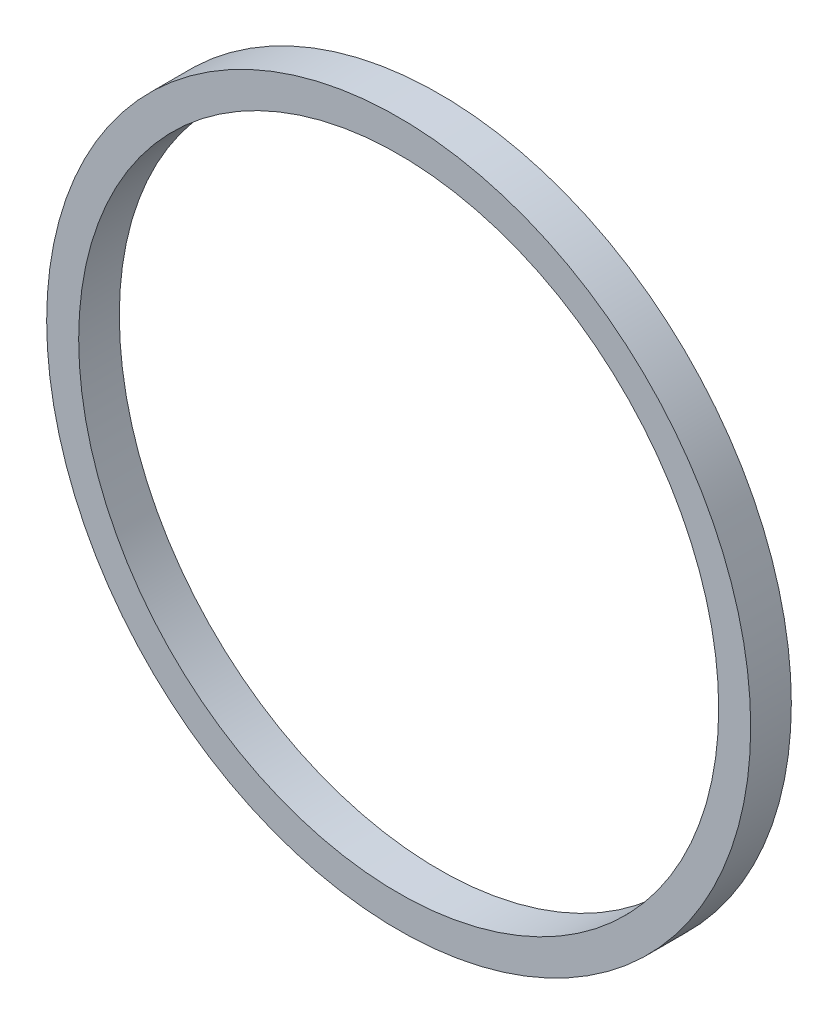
from build123d import *

# Parameters (mm, degrees)
EXTRUDE1_DEPTH      = 3.175
EXTRUDE1_DEPTH_BACK = 3.175
SKETCH1_R           = 55
SKETCH1_R_2         = 50


with BuildPart() as part:
    # Sketch1 → Extrude1 (new, two sides: drawn at the far end of the back side and taken through both)
    with BuildSketch(Plane.XY.offset(-EXTRUDE1_DEPTH_BACK)):
        Circle(SKETCH1_R)
        Circle(SKETCH1_R_2, mode=Mode.SUBTRACT)
    extrude(amount=EXTRUDE1_DEPTH + EXTRUDE1_DEPTH_BACK)


solid = part.part
